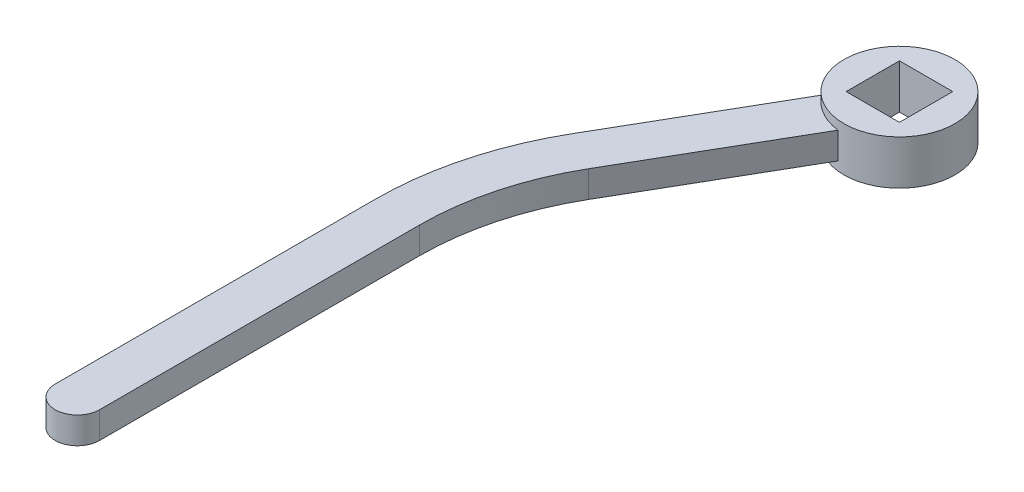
ISO-10303-21;
HEADER;
FILE_DESCRIPTION(('STEP AP214'),'2;1');
FILE_NAME('part.step','',(''),(''),'','','');
FILE_SCHEMA(('AUTOMOTIVE_DESIGN { 1 0 10303 214 1 1 1 1 }'));
ENDSEC;
DATA;
#1=APPLICATION_CONTEXT('core data for automotive mechanical design processes');
#2=APPLICATION_PROTOCOL_DEFINITION('international standard','automotive_design',2000,#1);
#3=PRODUCT_CONTEXT('',#1,'mechanical');
#4=PRODUCT('Part','Part','',(#3));
#5=PRODUCT_RELATED_PRODUCT_CATEGORY('part','',(#4));
#6=PRODUCT_DEFINITION_FORMATION('','',#4);
#7=PRODUCT_DEFINITION_CONTEXT('part definition',#1,'design');
#8=PRODUCT_DEFINITION('design','',#6,#7);
#9=PRODUCT_DEFINITION_SHAPE('','',#8);
#10=(LENGTH_UNIT() NAMED_UNIT(*) SI_UNIT(.MILLI.,.METRE.));
#11=(NAMED_UNIT(*) PLANE_ANGLE_UNIT() SI_UNIT($,.RADIAN.));
#12=(NAMED_UNIT(*) SI_UNIT($,.STERADIAN.) SOLID_ANGLE_UNIT());
#13=UNCERTAINTY_MEASURE_WITH_UNIT(LENGTH_MEASURE(1.E-05),#10,'distance_accuracy_value','');
#14=(GEOMETRIC_REPRESENTATION_CONTEXT(3) GLOBAL_UNCERTAINTY_ASSIGNED_CONTEXT((#13)) GLOBAL_UNIT_ASSIGNED_CONTEXT((#10,
#11,#12)) REPRESENTATION_CONTEXT('',''));
#15=CARTESIAN_POINT('',(0.,0.,0.));
#16=DIRECTION('',(0.,0.,1.));
#17=DIRECTION('',(1.,0.,0.));
#18=AXIS2_PLACEMENT_3D('',#15,#16,#17);
#19=CARTESIAN_POINT('',(35.,5.,-150.));
#20=DIRECTION('',(0.,-1.,0.));
#21=DIRECTION('',(0.,0.,-1.));
#22=AXIS2_PLACEMENT_3D('',#19,#20,#21);
#23=CYLINDRICAL_SURFACE('',#22,12.5);
#24=CARTESIAN_POINT('',(35.,-5.,-150.));
#25=DIRECTION('',(0.,1.,0.));
#26=DIRECTION('',(0.,0.,1.));
#27=AXIS2_PLACEMENT_3D('',#24,#25,#26);
#28=CIRCLE('',#27,12.5);
#29=CARTESIAN_POINT('',(35.,-5.,-137.5));
#30=VERTEX_POINT('',#29);
#31=EDGE_CURVE('E151',#30,#30,#28,.T.);
#32=ORIENTED_EDGE('',*,*,#31,.T.);
#33=EDGE_LOOP('',(#32));
#34=FACE_BOUND('',#33,.T.);
#35=CARTESIAN_POINT('',(35.,5.,-150.));
#36=DIRECTION('',(0.,1.,0.));
#37=DIRECTION('',(0.,0.,1.));
#38=AXIS2_PLACEMENT_3D('',#35,#36,#37);
#39=CIRCLE('',#38,12.5);
#40=CARTESIAN_POINT('',(35.,5.,-137.5));
#41=VERTEX_POINT('',#40);
#42=EDGE_CURVE('E156',#41,#41,#39,.T.);
#43=ORIENTED_EDGE('',*,*,#42,.F.);
#44=EDGE_LOOP('',(#43));
#45=FACE_BOUND('',#44,.T.);
#46=DIRECTION('',(0.,-1.,0.));
#47=VECTOR('',#46,1.);
#48=CARTESIAN_POINT('',(24.941653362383,5.,-142.578432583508));
#49=LINE('',#48,#47);
#50=CARTESIAN_POINT('',(24.941653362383,-3.,-142.578432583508));
#51=VERTEX_POINT('',#50);
#52=CARTESIAN_POINT('',(24.941653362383,3.,-142.578432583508));
#53=VERTEX_POINT('',#52);
#54=EDGE_CURVE('E159',#51,#53,#49,.F.);
#55=ORIENTED_EDGE('',*,*,#54,.T.);
#56=CARTESIAN_POINT('',(35.,3.,-150.));
#57=DIRECTION('',(0.,-1.,0.));
#58=DIRECTION('',(0.,0.,-1.));
#59=AXIS2_PLACEMENT_3D('',#56,#57,#58);
#60=CIRCLE('',#59,12.5);
#61=CARTESIAN_POINT('',(33.6019074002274,3.,-137.578432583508));
#62=VERTEX_POINT('',#61);
#63=EDGE_CURVE('E163',#53,#62,#60,.F.);
#64=ORIENTED_EDGE('',*,*,#63,.T.);
#65=DIRECTION('',(0.,-1.,0.));
#66=VECTOR('',#65,1.);
#67=CARTESIAN_POINT('',(33.6019074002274,5.,-137.578432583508));
#68=LINE('',#67,#66);
#69=CARTESIAN_POINT('',(33.6019074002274,-3.,-137.578432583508));
#70=VERTEX_POINT('',#69);
#71=EDGE_CURVE('E161',#62,#70,#68,.T.);
#72=ORIENTED_EDGE('',*,*,#71,.T.);
#73=CARTESIAN_POINT('',(35.,-3.,-150.));
#74=DIRECTION('',(0.,-1.,0.));
#75=DIRECTION('',(0.,0.,-1.));
#76=AXIS2_PLACEMENT_3D('',#73,#74,#75);
#77=CIRCLE('',#76,12.5);
#78=EDGE_CURVE('E11',#51,#70,#77,.F.);
#79=ORIENTED_EDGE('',*,*,#78,.F.);
#80=EDGE_LOOP('',(#55,#64,#72,#79));
#81=FACE_BOUND('',#80,.T.);
#82=ADVANCED_FACE('F28',(#34,#45,#81),#23,.T.);
#83=CARTESIAN_POINT('',(35.,5.,-150.));
#84=DIRECTION('',(0.,1.,0.));
#85=DIRECTION('',(0.,0.,1.));
#86=AXIS2_PLACEMENT_3D('',#83,#84,#85);
#87=PLANE('',#86);
#88=DIRECTION('',(0.,0.,1.));
#89=VECTOR('',#88,1.);
#90=CARTESIAN_POINT('',(29.,5.,-156.));
#91=LINE('',#90,#89);
#92=CARTESIAN_POINT('',(29.,5.,-156.));
#93=VERTEX_POINT('',#92);
#94=CARTESIAN_POINT('',(29.,5.,-144.));
#95=VERTEX_POINT('',#94);
#96=EDGE_CURVE('E43',#93,#95,#91,.T.);
#97=ORIENTED_EDGE('',*,*,#96,.F.);
#98=DIRECTION('',(-1.,0.,0.));
#99=VECTOR('',#98,1.);
#100=CARTESIAN_POINT('',(29.,5.,-156.));
#101=LINE('',#100,#99);
#102=CARTESIAN_POINT('',(41.,5.,-156.));
#103=VERTEX_POINT('',#102);
#104=EDGE_CURVE('E135',#103,#93,#101,.T.);
#105=ORIENTED_EDGE('',*,*,#104,.F.);
#106=DIRECTION('',(0.,0.,-1.));
#107=VECTOR('',#106,1.);
#108=CARTESIAN_POINT('',(41.,5.,-156.));
#109=LINE('',#108,#107);
#110=CARTESIAN_POINT('',(41.,5.,-144.));
#111=VERTEX_POINT('',#110);
#112=EDGE_CURVE('E119',#111,#103,#109,.T.);
#113=ORIENTED_EDGE('',*,*,#112,.F.);
#114=DIRECTION('',(1.,0.,0.));
#115=VECTOR('',#114,1.);
#116=CARTESIAN_POINT('',(29.,5.,-144.));
#117=LINE('',#116,#115);
#118=EDGE_CURVE('E128',#95,#111,#117,.T.);
#119=ORIENTED_EDGE('',*,*,#118,.F.);
#120=EDGE_LOOP('',(#97,#105,#113,#119));
#121=FACE_BOUND('',#120,.T.);
#122=ORIENTED_EDGE('',*,*,#42,.T.);
#123=EDGE_LOOP('',(#122));
#124=FACE_BOUND('',#123,.T.);
#125=ADVANCED_FACE('F132',(#121,#124),#87,.T.);
#126=CARTESIAN_POINT('',(35.,-5.,-150.));
#127=DIRECTION('',(0.,1.,0.));
#128=DIRECTION('',(0.,0.,1.));
#129=AXIS2_PLACEMENT_3D('',#126,#127,#128);
#130=PLANE('',#129);
#131=DIRECTION('',(-1.,0.,0.));
#132=VECTOR('',#131,1.);
#133=CARTESIAN_POINT('',(29.,-5.,-156.));
#134=LINE('',#133,#132);
#135=CARTESIAN_POINT('',(41.,-5.,-156.));
#136=VERTEX_POINT('',#135);
#137=CARTESIAN_POINT('',(29.,-5.,-156.));
#138=VERTEX_POINT('',#137);
#139=EDGE_CURVE('E146',#136,#138,#134,.T.);
#140=ORIENTED_EDGE('',*,*,#139,.T.);
#141=DIRECTION('',(0.,0.,1.));
#142=VECTOR('',#141,1.);
#143=CARTESIAN_POINT('',(29.,-5.,-156.));
#144=LINE('',#143,#142);
#145=CARTESIAN_POINT('',(29.,-5.,-144.));
#146=VERTEX_POINT('',#145);
#147=EDGE_CURVE('E137',#138,#146,#144,.T.);
#148=ORIENTED_EDGE('',*,*,#147,.T.);
#149=DIRECTION('',(1.,0.,0.));
#150=VECTOR('',#149,1.);
#151=CARTESIAN_POINT('',(29.,-5.,-144.));
#152=LINE('',#151,#150);
#153=CARTESIAN_POINT('',(41.,-5.,-144.));
#154=VERTEX_POINT('',#153);
#155=EDGE_CURVE('E143',#146,#154,#152,.T.);
#156=ORIENTED_EDGE('',*,*,#155,.T.);
#157=DIRECTION('',(0.,0.,-1.));
#158=VECTOR('',#157,1.);
#159=CARTESIAN_POINT('',(41.,-5.,-156.));
#160=LINE('',#159,#158);
#161=EDGE_CURVE('E51',#154,#136,#160,.T.);
#162=ORIENTED_EDGE('',*,*,#161,.T.);
#163=EDGE_LOOP('',(#140,#148,#156,#162));
#164=FACE_BOUND('',#163,.T.);
#165=ORIENTED_EDGE('',*,*,#31,.F.);
#166=EDGE_LOOP('',(#165));
#167=FACE_BOUND('',#166,.T.);
#168=ADVANCED_FACE('F269',(#164,#167),#130,.F.);
#169=CARTESIAN_POINT('',(13.0384757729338,3.,-101.961524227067));
#170=DIRECTION('',(-0.866025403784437,0.,-0.500000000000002));
#171=DIRECTION('',(-0.500000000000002,0.,0.866025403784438));
#172=AXIS2_PLACEMENT_3D('',#169,#170,#171);
#173=PLANE('',#172);
#174=ORIENTED_EDGE('',*,*,#71,.F.);
#175=DIRECTION('',(0.500000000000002,0.,-0.866025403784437));
#176=VECTOR('',#175,1.);
#177=CARTESIAN_POINT('',(13.0384757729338,3.,-101.961524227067));
#178=LINE('',#177,#176);
#179=CARTESIAN_POINT('',(13.0384757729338,3.,-101.961524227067));
#180=VERTEX_POINT('',#179);
#181=EDGE_CURVE('E192',#180,#62,#178,.T.);
#182=ORIENTED_EDGE('',*,*,#181,.F.);
#183=DIRECTION('',(0.,-1.,0.));
#184=VECTOR('',#183,1.);
#185=CARTESIAN_POINT('',(13.0384757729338,3.,-101.961524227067));
#186=LINE('',#185,#184);
#187=CARTESIAN_POINT('',(13.0384757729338,-3.,-101.961524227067));
#188=VERTEX_POINT('',#187);
#189=EDGE_CURVE('E200',#180,#188,#186,.T.);
#190=ORIENTED_EDGE('',*,*,#189,.T.);
#191=DIRECTION('',(0.500000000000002,0.,-0.866025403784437));
#192=VECTOR('',#191,1.);
#193=CARTESIAN_POINT('',(13.0384757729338,-3.,-101.961524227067));
#194=LINE('',#193,#192);
#195=EDGE_CURVE('E176',#188,#70,#194,.T.);
#196=ORIENTED_EDGE('',*,*,#195,.T.);
#197=EDGE_LOOP('',(#174,#182,#190,#196));
#198=FACE_BOUND('',#197,.T.);
#199=ADVANCED_FACE('F247',(#198),#173,.F.);
#200=CARTESIAN_POINT('',(4.37822173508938,3.,-106.961524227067));
#201=DIRECTION('',(0.866025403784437,0.,0.500000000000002));
#202=DIRECTION('',(0.500000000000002,0.,-0.866025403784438));
#203=AXIS2_PLACEMENT_3D('',#200,#201,#202);
#204=PLANE('',#203);
#205=ORIENTED_EDGE('',*,*,#54,.F.);
#206=DIRECTION('',(-0.500000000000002,0.,0.866025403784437));
#207=VECTOR('',#206,1.);
#208=CARTESIAN_POINT('',(4.37822173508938,-3.,-106.961524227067));
#209=LINE('',#208,#207);
#210=CARTESIAN_POINT('',(4.37822173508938,-3.,-106.961524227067));
#211=VERTEX_POINT('',#210);
#212=EDGE_CURVE('E179',#51,#211,#209,.T.);
#213=ORIENTED_EDGE('',*,*,#212,.T.);
#214=DIRECTION('',(0.,-1.,0.));
#215=VECTOR('',#214,1.);
#216=CARTESIAN_POINT('',(4.37822173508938,3.,-106.961524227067));
#217=LINE('',#216,#215);
#218=CARTESIAN_POINT('',(4.37822173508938,3.,-106.961524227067));
#219=VERTEX_POINT('',#218);
#220=EDGE_CURVE('E197',#219,#211,#217,.T.);
#221=ORIENTED_EDGE('',*,*,#220,.F.);
#222=DIRECTION('',(-0.500000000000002,0.,0.866025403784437));
#223=VECTOR('',#222,1.);
#224=CARTESIAN_POINT('',(4.37822173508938,3.,-106.961524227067));
#225=LINE('',#224,#223);
#226=EDGE_CURVE('E195',#53,#219,#225,.T.);
#227=ORIENTED_EDGE('',*,*,#226,.F.);
#228=EDGE_LOOP('',(#205,#213,#221,#227));
#229=FACE_BOUND('',#228,.T.);
#230=ADVANCED_FACE('F242',(#229),#204,.F.);
#231=CARTESIAN_POINT('',(65.,3.,-71.9615242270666));
#232=DIRECTION('',(0.,-1.,0.));
#233=DIRECTION('',(0.,0.,-1.));
#234=AXIS2_PLACEMENT_3D('',#231,#232,#233);
#235=PLANE('',#234);
#236=ORIENTED_EDGE('',*,*,#63,.F.);
#237=ORIENTED_EDGE('',*,*,#226,.T.);
#238=CARTESIAN_POINT('',(65.,3.,-71.9615242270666));
#239=DIRECTION('',(0.,1.,0.));
#240=DIRECTION('',(0.,0.,-1.));
#241=AXIS2_PLACEMENT_3D('',#238,#239,#240);
#242=CIRCLE('',#241,70.);
#243=CARTESIAN_POINT('',(-5.,3.,-71.9615242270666));
#244=VERTEX_POINT('',#243);
#245=EDGE_CURVE('E181',#219,#244,#242,.T.);
#246=ORIENTED_EDGE('',*,*,#245,.T.);
#247=DIRECTION('',(0.,0.,1.));
#248=VECTOR('',#247,1.);
#249=CARTESIAN_POINT('',(-5.,3.,0.));
#250=LINE('',#249,#248);
#251=CARTESIAN_POINT('',(-5.,3.,0.));
#252=VERTEX_POINT('',#251);
#253=EDGE_CURVE('E184',#244,#252,#250,.T.);
#254=ORIENTED_EDGE('',*,*,#253,.T.);
#255=CARTESIAN_POINT('',(0.,3.,0.));
#256=DIRECTION('',(0.,1.,0.));
#257=DIRECTION('',(0.,0.,1.));
#258=AXIS2_PLACEMENT_3D('',#255,#256,#257);
#259=CIRCLE('',#258,5.);
#260=CARTESIAN_POINT('',(5.,3.,0.));
#261=VERTEX_POINT('',#260);
#262=EDGE_CURVE('E186',#252,#261,#259,.T.);
#263=ORIENTED_EDGE('',*,*,#262,.T.);
#264=DIRECTION('',(0.,0.,-1.));
#265=VECTOR('',#264,1.);
#266=CARTESIAN_POINT('',(5.,3.,0.));
#267=LINE('',#266,#265);
#268=CARTESIAN_POINT('',(5.00000000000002,3.,-71.9615242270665));
#269=VERTEX_POINT('',#268);
#270=EDGE_CURVE('E188',#261,#269,#267,.T.);
#271=ORIENTED_EDGE('',*,*,#270,.T.);
#272=CARTESIAN_POINT('',(65.,3.,-71.9615242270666));
#273=DIRECTION('',(0.,-1.,0.));
#274=DIRECTION('',(0.,0.,-1.));
#275=AXIS2_PLACEMENT_3D('',#272,#273,#274);
#276=CIRCLE('',#275,60.);
#277=EDGE_CURVE('E190',#269,#180,#276,.T.);
#278=ORIENTED_EDGE('',*,*,#277,.T.);
#279=ORIENTED_EDGE('',*,*,#181,.T.);
#280=EDGE_LOOP('',(#236,#237,#246,#254,#263,#271,#278,#279));
#281=FACE_BOUND('',#280,.T.);
#282=ADVANCED_FACE('F237',(#281),#235,.F.);
#283=CARTESIAN_POINT('',(65.,-3.,-71.9615242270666));
#284=DIRECTION('',(0.,-1.,0.));
#285=DIRECTION('',(0.,0.,-1.));
#286=AXIS2_PLACEMENT_3D('',#283,#284,#285);
#287=PLANE('',#286);
#288=ORIENTED_EDGE('',*,*,#212,.F.);
#289=ORIENTED_EDGE('',*,*,#78,.T.);
#290=ORIENTED_EDGE('',*,*,#195,.F.);
#291=CARTESIAN_POINT('',(65.,-3.,-71.9615242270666));
#292=DIRECTION('',(0.,-1.,0.));
#293=DIRECTION('',(0.,0.,-1.));
#294=AXIS2_PLACEMENT_3D('',#291,#292,#293);
#295=CIRCLE('',#294,60.);
#296=CARTESIAN_POINT('',(5.00000000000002,-3.,-71.9615242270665));
#297=VERTEX_POINT('',#296);
#298=EDGE_CURVE('E174',#297,#188,#295,.T.);
#299=ORIENTED_EDGE('',*,*,#298,.F.);
#300=DIRECTION('',(0.,0.,-1.));
#301=VECTOR('',#300,1.);
#302=CARTESIAN_POINT('',(5.,-3.,0.));
#303=LINE('',#302,#301);
#304=CARTESIAN_POINT('',(5.,-3.,0.));
#305=VERTEX_POINT('',#304);
#306=EDGE_CURVE('E172',#305,#297,#303,.T.);
#307=ORIENTED_EDGE('',*,*,#306,.F.);
#308=CARTESIAN_POINT('',(0.,-3.,0.));
#309=DIRECTION('',(0.,1.,0.));
#310=DIRECTION('',(0.,0.,1.));
#311=AXIS2_PLACEMENT_3D('',#308,#309,#310);
#312=CIRCLE('',#311,5.);
#313=CARTESIAN_POINT('',(-5.,-3.,0.));
#314=VERTEX_POINT('',#313);
#315=EDGE_CURVE('E170',#314,#305,#312,.T.);
#316=ORIENTED_EDGE('',*,*,#315,.F.);
#317=DIRECTION('',(0.,0.,1.));
#318=VECTOR('',#317,1.);
#319=CARTESIAN_POINT('',(-5.,-3.,0.));
#320=LINE('',#319,#318);
#321=CARTESIAN_POINT('',(-5.,-3.,-71.9615242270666));
#322=VERTEX_POINT('',#321);
#323=EDGE_CURVE('E168',#322,#314,#320,.T.);
#324=ORIENTED_EDGE('',*,*,#323,.F.);
#325=CARTESIAN_POINT('',(65.,-3.,-71.9615242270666));
#326=DIRECTION('',(0.,1.,0.));
#327=DIRECTION('',(0.,0.,-1.));
#328=AXIS2_PLACEMENT_3D('',#325,#326,#327);
#329=CIRCLE('',#328,70.);
#330=EDGE_CURVE('E165',#211,#322,#329,.T.);
#331=ORIENTED_EDGE('',*,*,#330,.F.);
#332=EDGE_LOOP('',(#288,#289,#290,#299,#307,#316,#324,#331));
#333=FACE_BOUND('',#332,.T.);
#334=ADVANCED_FACE('F222',(#333),#287,.T.);
#335=CARTESIAN_POINT('',(65.,3.,-71.9615242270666));
#336=DIRECTION('',(0.,-1.,0.));
#337=DIRECTION('',(0.,0.,-1.));
#338=AXIS2_PLACEMENT_3D('',#335,#336,#337);
#339=CYLINDRICAL_SURFACE('',#338,70.);
#340=ORIENTED_EDGE('',*,*,#330,.T.);
#341=DIRECTION('',(0.,-1.,0.));
#342=VECTOR('',#341,1.);
#343=CARTESIAN_POINT('',(-5.,3.,-71.9615242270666));
#344=LINE('',#343,#342);
#345=EDGE_CURVE('E36',#244,#322,#344,.T.);
#346=ORIENTED_EDGE('',*,*,#345,.F.);
#347=ORIENTED_EDGE('',*,*,#245,.F.);
#348=ORIENTED_EDGE('',*,*,#220,.T.);
#349=EDGE_LOOP('',(#340,#346,#347,#348));
#350=FACE_BOUND('',#349,.T.);
#351=ADVANCED_FACE('F30',(#350),#339,.T.);
#352=CARTESIAN_POINT('',(-5.,3.,0.));
#353=DIRECTION('',(1.,0.,0.));
#354=DIRECTION('',(0.,0.,-1.));
#355=AXIS2_PLACEMENT_3D('',#352,#353,#354);
#356=PLANE('',#355);
#357=ORIENTED_EDGE('',*,*,#323,.T.);
#358=DIRECTION('',(0.,-1.,0.));
#359=VECTOR('',#358,1.);
#360=CARTESIAN_POINT('',(-5.,3.,0.));
#361=LINE('',#360,#359);
#362=EDGE_CURVE('E209',#252,#314,#361,.T.);
#363=ORIENTED_EDGE('',*,*,#362,.F.);
#364=ORIENTED_EDGE('',*,*,#253,.F.);
#365=ORIENTED_EDGE('',*,*,#345,.T.);
#366=EDGE_LOOP('',(#357,#363,#364,#365));
#367=FACE_BOUND('',#366,.T.);
#368=ADVANCED_FACE('F214',(#367),#356,.F.);
#369=CARTESIAN_POINT('',(0.,3.,0.));
#370=DIRECTION('',(0.,-1.,0.));
#371=DIRECTION('',(0.,0.,-1.));
#372=AXIS2_PLACEMENT_3D('',#369,#370,#371);
#373=CYLINDRICAL_SURFACE('',#372,5.);
#374=ORIENTED_EDGE('',*,*,#315,.T.);
#375=DIRECTION('',(0.,-1.,0.));
#376=VECTOR('',#375,1.);
#377=CARTESIAN_POINT('',(5.,3.,0.));
#378=LINE('',#377,#376);
#379=EDGE_CURVE('E206',#261,#305,#378,.T.);
#380=ORIENTED_EDGE('',*,*,#379,.F.);
#381=ORIENTED_EDGE('',*,*,#262,.F.);
#382=ORIENTED_EDGE('',*,*,#362,.T.);
#383=EDGE_LOOP('',(#374,#380,#381,#382));
#384=FACE_BOUND('',#383,.T.);
#385=ADVANCED_FACE('F228',(#384),#373,.T.);
#386=CARTESIAN_POINT('',(5.,3.,0.));
#387=DIRECTION('',(-1.,0.,0.));
#388=DIRECTION('',(0.,0.,1.));
#389=AXIS2_PLACEMENT_3D('',#386,#387,#388);
#390=PLANE('',#389);
#391=ORIENTED_EDGE('',*,*,#306,.T.);
#392=DIRECTION('',(0.,-1.,0.));
#393=VECTOR('',#392,1.);
#394=CARTESIAN_POINT('',(5.00000000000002,3.,-71.9615242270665));
#395=LINE('',#394,#393);
#396=EDGE_CURVE('E203',#269,#297,#395,.T.);
#397=ORIENTED_EDGE('',*,*,#396,.F.);
#398=ORIENTED_EDGE('',*,*,#270,.F.);
#399=ORIENTED_EDGE('',*,*,#379,.T.);
#400=EDGE_LOOP('',(#391,#397,#398,#399));
#401=FACE_BOUND('',#400,.T.);
#402=ADVANCED_FACE('F232',(#401),#390,.F.);
#403=CARTESIAN_POINT('',(65.,3.,-71.9615242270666));
#404=DIRECTION('',(0.,-1.,0.));
#405=DIRECTION('',(0.,0.,-1.));
#406=AXIS2_PLACEMENT_3D('',#403,#404,#405);
#407=CYLINDRICAL_SURFACE('',#406,60.);
#408=ORIENTED_EDGE('',*,*,#298,.T.);
#409=ORIENTED_EDGE('',*,*,#189,.F.);
#410=ORIENTED_EDGE('',*,*,#277,.F.);
#411=ORIENTED_EDGE('',*,*,#396,.T.);
#412=EDGE_LOOP('',(#408,#409,#410,#411));
#413=FACE_BOUND('',#412,.T.);
#414=ADVANCED_FACE('F250',(#413),#407,.F.);
#415=CARTESIAN_POINT('',(29.,-5.,-156.));
#416=DIRECTION('',(-1.,0.,0.));
#417=DIRECTION('',(0.,0.,1.));
#418=AXIS2_PLACEMENT_3D('',#415,#416,#417);
#419=PLANE('',#418);
#420=ORIENTED_EDGE('',*,*,#96,.T.);
#421=DIRECTION('',(0.,1.,0.));
#422=VECTOR('',#421,1.);
#423=CARTESIAN_POINT('',(29.,-5.,-144.));
#424=LINE('',#423,#422);
#425=EDGE_CURVE('E125',#146,#95,#424,.T.);
#426=ORIENTED_EDGE('',*,*,#425,.F.);
#427=ORIENTED_EDGE('',*,*,#147,.F.);
#428=DIRECTION('',(0.,1.,0.));
#429=VECTOR('',#428,1.);
#430=CARTESIAN_POINT('',(29.,-5.,-156.));
#431=LINE('',#430,#429);
#432=EDGE_CURVE('E149',#138,#93,#431,.T.);
#433=ORIENTED_EDGE('',*,*,#432,.T.);
#434=EDGE_LOOP('',(#420,#426,#427,#433));
#435=FACE_BOUND('',#434,.T.);
#436=ADVANCED_FACE('F252',(#435),#419,.F.);
#437=CARTESIAN_POINT('',(29.,-5.,-156.));
#438=DIRECTION('',(0.,0.,-1.));
#439=DIRECTION('',(-1.,0.,0.));
#440=AXIS2_PLACEMENT_3D('',#437,#438,#439);
#441=PLANE('',#440);
#442=ORIENTED_EDGE('',*,*,#104,.T.);
#443=ORIENTED_EDGE('',*,*,#432,.F.);
#444=ORIENTED_EDGE('',*,*,#139,.F.);
#445=DIRECTION('',(0.,1.,0.));
#446=VECTOR('',#445,1.);
#447=CARTESIAN_POINT('',(41.,-5.,-156.));
#448=LINE('',#447,#446);
#449=EDGE_CURVE('E124',#136,#103,#448,.T.);
#450=ORIENTED_EDGE('',*,*,#449,.T.);
#451=EDGE_LOOP('',(#442,#443,#444,#450));
#452=FACE_BOUND('',#451,.T.);
#453=ADVANCED_FACE('F259',(#452),#441,.F.);
#454=CARTESIAN_POINT('',(41.,-5.,-156.));
#455=DIRECTION('',(1.,0.,0.));
#456=DIRECTION('',(0.,0.,-1.));
#457=AXIS2_PLACEMENT_3D('',#454,#455,#456);
#458=PLANE('',#457);
#459=ORIENTED_EDGE('',*,*,#112,.T.);
#460=ORIENTED_EDGE('',*,*,#449,.F.);
#461=ORIENTED_EDGE('',*,*,#161,.F.);
#462=DIRECTION('',(0.,1.,0.));
#463=VECTOR('',#462,1.);
#464=CARTESIAN_POINT('',(41.,-5.,-144.));
#465=LINE('',#464,#463);
#466=EDGE_CURVE('E115',#154,#111,#465,.T.);
#467=ORIENTED_EDGE('',*,*,#466,.T.);
#468=EDGE_LOOP('',(#459,#460,#461,#467));
#469=FACE_BOUND('',#468,.T.);
#470=ADVANCED_FACE('F117',(#469),#458,.F.);
#471=CARTESIAN_POINT('',(29.,-5.,-144.));
#472=DIRECTION('',(0.,0.,1.));
#473=DIRECTION('',(1.,0.,0.));
#474=AXIS2_PLACEMENT_3D('',#471,#472,#473);
#475=PLANE('',#474);
#476=ORIENTED_EDGE('',*,*,#118,.T.);
#477=ORIENTED_EDGE('',*,*,#466,.F.);
#478=ORIENTED_EDGE('',*,*,#155,.F.);
#479=ORIENTED_EDGE('',*,*,#425,.T.);
#480=EDGE_LOOP('',(#476,#477,#478,#479));
#481=FACE_BOUND('',#480,.T.);
#482=ADVANCED_FACE('F129',(#481),#475,.F.);
#483=CLOSED_SHELL('',(#82,#125,#168,#199,#230,#282,#334,#351,#368,#385,#402,#414,#436,#453,#470,#482));
#484=MANIFOLD_SOLID_BREP('B2',#483);
#485=ADVANCED_BREP_SHAPE_REPRESENTATION('',(#18,#484),#14);
#486=SHAPE_DEFINITION_REPRESENTATION(#9,#485);
ENDSEC;
END-ISO-10303-21;
